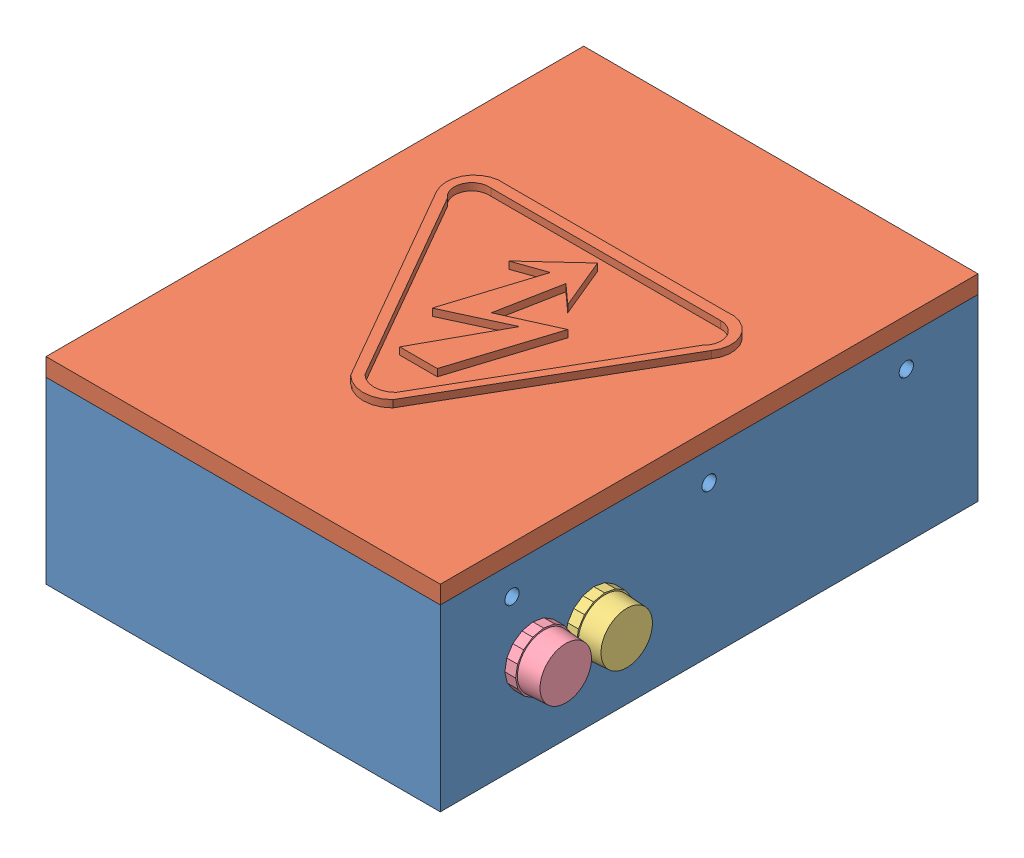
SolidWorks assembly Ensamblaje 4.SLDASM, configuration Predeterminado (file format 11000). Lengths in mm.
Overall size (129 57 150).
5 component instances, 4 part files, 0 mates.
Components (placement in the parent):
- Ensamblaje3-1: Ensamblaje3.SLDASM [Predeterminado] at (16.7185 -53.6163 398.4249) x (-1 0 0) z (0 1 0) size (129 150 57)
  - base de circuito-1: base de circuito.SLDPRT [Predeterminado] at (-7.6193 6.0954 125) size (120 150 50)
  - tapa de circuito-1: tapa de circuito.SLDPRT [Predeterminado] at (-7.6193 6.0954 160) size (110 150 22)
  - Lampara Indicadora-1: Lampara Indicadora.SLDPRT [Predeterminado] at (-65.6193 38.0954 150) x (0 -1 0) z (-1 0 0) size (16 16 29)
  - Lampara Indicadora 2-1: Lampara Indicadora 2.SLDPRT [Predeterminado] at (-65.6193 55.0954 150) x (0 0 1) z (-1 0 0) size (16 16 29)
